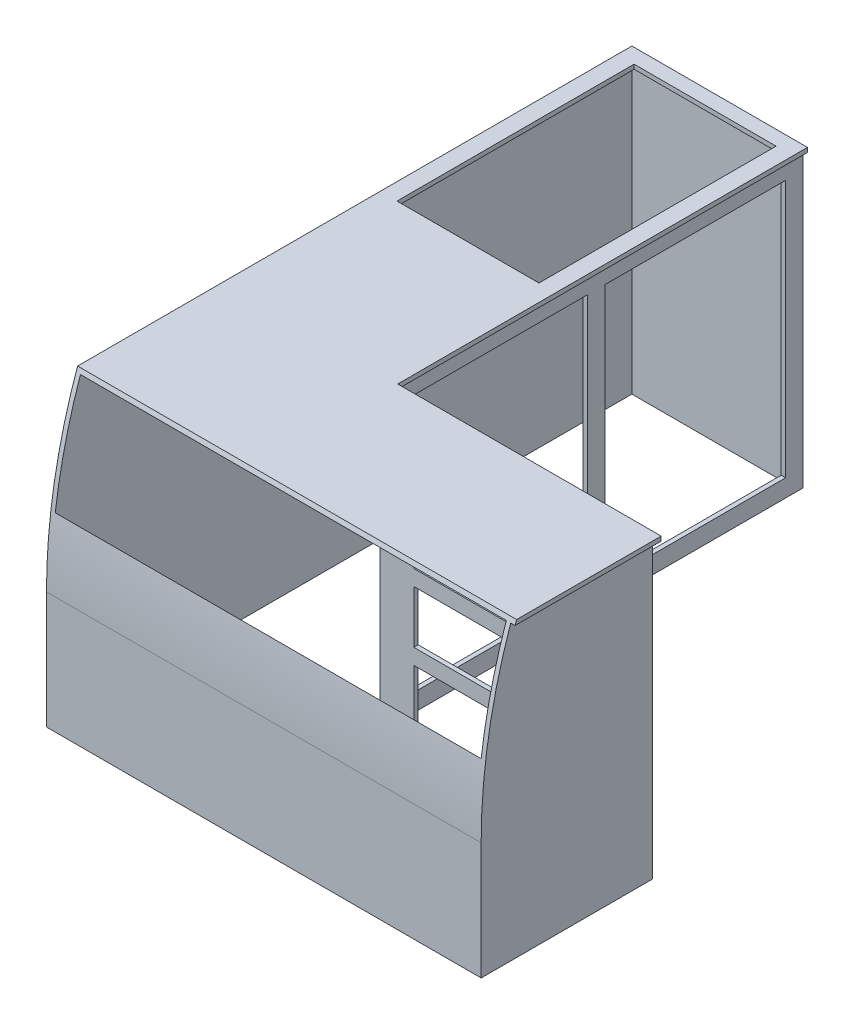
from build123d import *

# Parameters (mm, degrees)
SALIENTE_EXTRUIR1_DEPTH = 15
SALIENTE_EXTRUIR2_DEPTH = 1000
CROQUIS3_W              = 617.5
CROQUIS3_H              = 880
CORTAR_EXTRUIR1_DEPTH   = 50
CORTAR_EXTRUIR2_START   = -1485
CORTAR_EXTRUIR2_DEPTH   = 1500
CROQUIS5_W              = 700
CROQUIS5_H              = 180
CORTAR_EXTRUIR3_DEPTH   = 30
CROQUIS6_W              = 485
CROQUIS6_H              = 810
CORTAR_EXTRUIR4_DEPTH   = 30


with BuildPart() as part:
    # Croquis1 → Saliente-Extruir1 (new body)
    with BuildSketch(Plane(origin=(0, 0, 0), x_dir=(1, 0, 0), z_dir=(0, 1, 0))):
        Polygon((-391.153119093, 781.56899811), (508.846880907, 781.56899811), (508.846880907, 181.56899811), (-991.153119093, 181.56899811), (-991.153119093, 2181.56899811), (-391.153119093, 2181.56899811), align=None)
    extrude(amount=-SALIENTE_EXTRUIR1_DEPTH)

    # Croquis2 → Saliente-Extruir2 (add)
    with BuildSketch(Plane.XZ.offset(15)):
        Polygon((-991.153119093, -181.56899811), (493.846880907, -181.56899811), (493.846880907, -766.56899811), (-406.153119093, -766.56899811), (-406.153119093, -2181.56899811), (-991.153119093, -2181.56899811), (-991.153119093, -766.56899811), align=None)
        Polygon((-421.153119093, -751.56899811), (478.846880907, -751.56899811), (478.846880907, -196.56899811), (-976.153119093, -196.56899811), (-976.153119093, -766.56899811), (-976.153119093, -2166.56899811), (-421.153119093, -2166.56899811), align=None, mode=Mode.SUBTRACT)
    extrude(amount=SALIENTE_EXTRUIR2_DEPTH)

    # Croquis3 → Cortar-Extruir1 (cut)
    with BuildSketch(Plane(origin=(-406.153119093, 0, 0), x_dir=(0, 0, -1), z_dir=(1, 0, 0))):
        with Locations((1135.31899811, -515)):
            Rectangle(CROQUIS3_W, CROQUIS3_H)
        with Locations((1812.81899811, -515)):
            Rectangle(CROQUIS3_W, CROQUIS3_H)
    extrude(amount=-CORTAR_EXTRUIR1_DEPTH, mode=Mode.SUBTRACT)

    # Croquis4 → Cortar-Extruir2 (cut)
    with BuildSketch(Plane(origin=(493.846880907, 0, 0), x_dir=(0, 0, -1), z_dir=(1, 0, 0)).offset(CORTAR_EXTRUIR2_START)):
        with BuildLine():
            ThreePointArc((181.56899811, -615), (208.326341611, -302.944844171), (287.817203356, 0))
            Line((287.817203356, 0), (181.56899811, 0))
            Line((181.56899811, 0), (181.56899811, -615))
        make_face()
    extrude(amount=CORTAR_EXTRUIR2_DEPTH, mode=Mode.SUBTRACT)

    # Croquis5 → Cortar-Extruir3 (cut)
    with BuildSketch(Plane(origin=(0, 0, -766.56899811), x_dir=(-1, 0, 0), z_dir=(0, 0, -1))):
        with Locations((-43.846880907, -165)):
            Rectangle(CROQUIS5_W, CROQUIS5_H)
        with Locations((-43.846880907, -398.3)):
            Rectangle(CROQUIS5_W, CROQUIS5_H)
        with Locations((-43.846880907, -631.7)):
            Rectangle(CROQUIS5_W, CROQUIS5_H)
        with Locations((-43.846880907, -865)):
            Rectangle(CROQUIS5_W, CROQUIS5_H)
    extrude(amount=-CORTAR_EXTRUIR3_DEPTH, mode=Mode.SUBTRACT)

    # Croquis6 → Cortar-Extruir4 (cut)
    with BuildSketch(Plane(origin=(0, 0, 0), x_dir=(1, 0, 0), z_dir=(0, 1, 0))):
        with Locations((-691.153119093, 1726.56899811)):
            Rectangle(CROQUIS6_W, CROQUIS6_H)
    extrude(amount=-CORTAR_EXTRUIR4_DEPTH, mode=Mode.SUBTRACT)


solid = part.part
